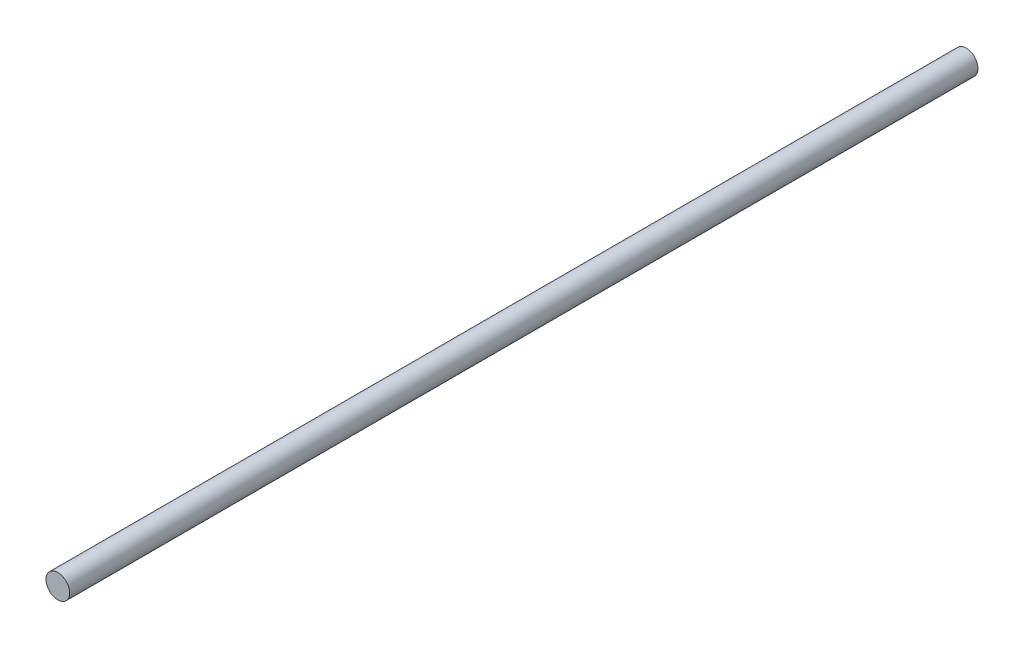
ISO-10303-21;
HEADER;
FILE_DESCRIPTION(('STEP AP214'),'2;1');
FILE_NAME('part.step','',(''),(''),'','','');
FILE_SCHEMA(('AUTOMOTIVE_DESIGN { 1 0 10303 214 1 1 1 1 }'));
ENDSEC;
DATA;
#1=APPLICATION_CONTEXT('core data for automotive mechanical design processes');
#2=APPLICATION_PROTOCOL_DEFINITION('international standard','automotive_design',2000,#1);
#3=PRODUCT_CONTEXT('',#1,'mechanical');
#4=PRODUCT('Part','Part','',(#3));
#5=PRODUCT_RELATED_PRODUCT_CATEGORY('part','',(#4));
#6=PRODUCT_DEFINITION_FORMATION('','',#4);
#7=PRODUCT_DEFINITION_CONTEXT('part definition',#1,'design');
#8=PRODUCT_DEFINITION('design','',#6,#7);
#9=PRODUCT_DEFINITION_SHAPE('','',#8);
#10=(LENGTH_UNIT() NAMED_UNIT(*) SI_UNIT(.MILLI.,.METRE.));
#11=(NAMED_UNIT(*) PLANE_ANGLE_UNIT() SI_UNIT($,.RADIAN.));
#12=(NAMED_UNIT(*) SI_UNIT($,.STERADIAN.) SOLID_ANGLE_UNIT());
#13=UNCERTAINTY_MEASURE_WITH_UNIT(LENGTH_MEASURE(1.E-05),#10,'distance_accuracy_value','');
#14=(GEOMETRIC_REPRESENTATION_CONTEXT(3) GLOBAL_UNCERTAINTY_ASSIGNED_CONTEXT((#13)) GLOBAL_UNIT_ASSIGNED_CONTEXT((#10,
#11,#12)) REPRESENTATION_CONTEXT('',''));
#15=CARTESIAN_POINT('',(0.,0.,0.));
#16=DIRECTION('',(0.,0.,1.));
#17=DIRECTION('',(1.,0.,0.));
#18=AXIS2_PLACEMENT_3D('',#15,#16,#17);
#19=CARTESIAN_POINT('',(0.,0.,-2300.));
#20=DIRECTION('',(0.,0.,1.));
#21=DIRECTION('',(1.,0.,0.));
#22=AXIS2_PLACEMENT_3D('',#19,#20,#21);
#23=CYLINDRICAL_SURFACE('',#22,30.);
#24=CARTESIAN_POINT('',(0.,0.,-2300.));
#25=DIRECTION('',(0.,0.,1.));
#26=DIRECTION('',(1.,0.,0.));
#27=AXIS2_PLACEMENT_3D('',#24,#25,#26);
#28=CIRCLE('',#27,30.);
#29=CARTESIAN_POINT('',(30.,0.,-2300.));
#30=VERTEX_POINT('',#29);
#31=EDGE_CURVE('E10',#30,#30,#28,.T.);
#32=ORIENTED_EDGE('',*,*,#31,.T.);
#33=EDGE_LOOP('',(#32));
#34=FACE_BOUND('',#33,.T.);
#35=CARTESIAN_POINT('',(0.,0.,0.));
#36=DIRECTION('',(0.,0.,1.));
#37=DIRECTION('',(1.,0.,0.));
#38=AXIS2_PLACEMENT_3D('',#35,#36,#37);
#39=CIRCLE('',#38,30.);
#40=CARTESIAN_POINT('',(30.,0.,0.));
#41=VERTEX_POINT('',#40);
#42=EDGE_CURVE('E40',#41,#41,#39,.T.);
#43=ORIENTED_EDGE('',*,*,#42,.F.);
#44=EDGE_LOOP('',(#43));
#45=FACE_BOUND('',#44,.T.);
#46=ADVANCED_FACE('F37',(#34,#45),#23,.T.);
#47=CARTESIAN_POINT('',(0.,0.,-2300.));
#48=DIRECTION('',(0.,0.,1.));
#49=DIRECTION('',(1.,0.,0.));
#50=AXIS2_PLACEMENT_3D('',#47,#48,#49);
#51=PLANE('',#50);
#52=ORIENTED_EDGE('',*,*,#31,.F.);
#53=EDGE_LOOP('',(#52));
#54=FACE_BOUND('',#53,.T.);
#55=ADVANCED_FACE('F54',(#54),#51,.F.);
#56=CARTESIAN_POINT('',(0.,0.,0.));
#57=DIRECTION('',(0.,0.,1.));
#58=DIRECTION('',(1.,0.,0.));
#59=AXIS2_PLACEMENT_3D('',#56,#57,#58);
#60=PLANE('',#59);
#61=ORIENTED_EDGE('',*,*,#42,.T.);
#62=EDGE_LOOP('',(#61));
#63=FACE_BOUND('',#62,.T.);
#64=ADVANCED_FACE('F51',(#63),#60,.T.);
#65=CLOSED_SHELL('',(#46,#55,#64));
#66=MANIFOLD_SOLID_BREP('B2',#65);
#67=ADVANCED_BREP_SHAPE_REPRESENTATION('',(#18,#66),#14);
#68=SHAPE_DEFINITION_REPRESENTATION(#9,#67);
ENDSEC;
END-ISO-10303-21;
